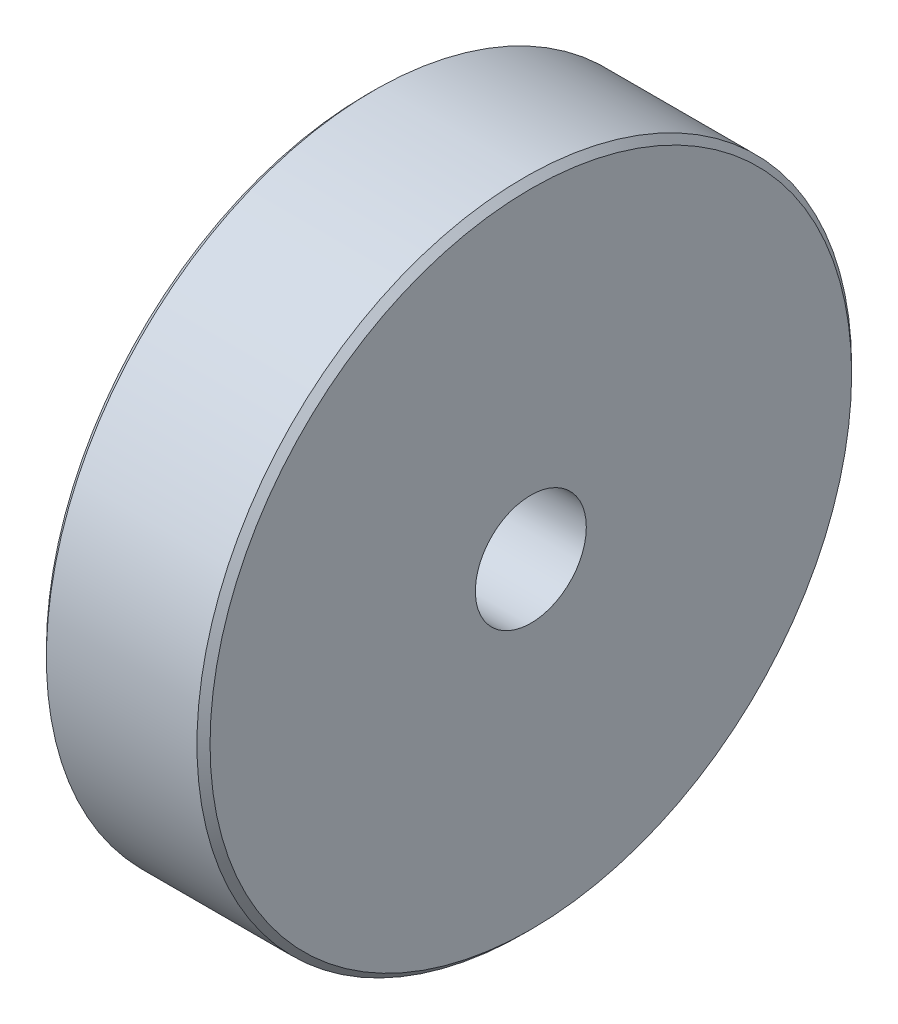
ISO-10303-21;
HEADER;
FILE_DESCRIPTION(('STEP AP214'),'2;1');
FILE_NAME('part.step','',(''),(''),'','','');
FILE_SCHEMA(('AUTOMOTIVE_DESIGN { 1 0 10303 214 1 1 1 1 }'));
ENDSEC;
DATA;
#1=APPLICATION_CONTEXT('core data for automotive mechanical design processes');
#2=APPLICATION_PROTOCOL_DEFINITION('international standard','automotive_design',2000,#1);
#3=PRODUCT_CONTEXT('',#1,'mechanical');
#4=PRODUCT('Part','Part','',(#3));
#5=PRODUCT_RELATED_PRODUCT_CATEGORY('part','',(#4));
#6=PRODUCT_DEFINITION_FORMATION('','',#4);
#7=PRODUCT_DEFINITION_CONTEXT('part definition',#1,'design');
#8=PRODUCT_DEFINITION('design','',#6,#7);
#9=PRODUCT_DEFINITION_SHAPE('','',#8);
#10=(LENGTH_UNIT() NAMED_UNIT(*) SI_UNIT(.MILLI.,.METRE.));
#11=(NAMED_UNIT(*) PLANE_ANGLE_UNIT() SI_UNIT($,.RADIAN.));
#12=(NAMED_UNIT(*) SI_UNIT($,.STERADIAN.) SOLID_ANGLE_UNIT());
#13=UNCERTAINTY_MEASURE_WITH_UNIT(LENGTH_MEASURE(1.E-05),#10,'distance_accuracy_value','');
#14=(GEOMETRIC_REPRESENTATION_CONTEXT(3) GLOBAL_UNCERTAINTY_ASSIGNED_CONTEXT((#13)) GLOBAL_UNIT_ASSIGNED_CONTEXT((#10,
#11,#12)) REPRESENTATION_CONTEXT('',''));
#15=CARTESIAN_POINT('',(0.,0.,0.));
#16=DIRECTION('',(0.,0.,1.));
#17=DIRECTION('',(1.,0.,0.));
#18=AXIS2_PLACEMENT_3D('',#15,#16,#17);
#19=CARTESIAN_POINT('',(6.35,0.,0.));
#20=DIRECTION('',(-1.,0.,0.));
#21=DIRECTION('',(0.,0.,1.));
#22=AXIS2_PLACEMENT_3D('',#19,#20,#21);
#23=CYLINDRICAL_SURFACE('',#22,12.7);
#24=CARTESIAN_POINT('',(6.096,0.,0.));
#25=DIRECTION('',(1.,0.,0.));
#26=DIRECTION('',(0.,0.,-1.));
#27=AXIS2_PLACEMENT_3D('',#24,#25,#26);
#28=CIRCLE('',#27,12.7);
#29=CARTESIAN_POINT('',(6.096,0.,-12.7));
#30=VERTEX_POINT('',#29);
#31=EDGE_CURVE('E40',#30,#30,#28,.F.);
#32=ORIENTED_EDGE('',*,*,#31,.T.);
#33=EDGE_LOOP('',(#32));
#34=FACE_BOUND('',#33,.T.);
#35=CARTESIAN_POINT('',(0.254000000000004,0.,0.));
#36=DIRECTION('',(1.,0.,0.));
#37=DIRECTION('',(0.,0.,-1.));
#38=AXIS2_PLACEMENT_3D('',#35,#36,#37);
#39=CIRCLE('',#38,12.7);
#40=CARTESIAN_POINT('',(0.254000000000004,0.,-12.7));
#41=VERTEX_POINT('',#40);
#42=EDGE_CURVE('E44',#41,#41,#39,.T.);
#43=ORIENTED_EDGE('',*,*,#42,.T.);
#44=EDGE_LOOP('',(#43));
#45=FACE_BOUND('',#44,.T.);
#46=ADVANCED_FACE('F33',(#34,#45),#23,.T.);
#47=CARTESIAN_POINT('',(6.35,0.,0.));
#48=DIRECTION('',(1.,0.,0.));
#49=DIRECTION('',(0.,0.,-1.));
#50=AXIS2_PLACEMENT_3D('',#47,#48,#49);
#51=PLANE('',#50);
#52=CARTESIAN_POINT('',(6.35,0.,0.));
#53=DIRECTION('',(1.,0.,0.));
#54=DIRECTION('',(0.,0.,-1.));
#55=AXIS2_PLACEMENT_3D('',#52,#53,#54);
#56=CIRCLE('',#55,12.446);
#57=CARTESIAN_POINT('',(6.35,0.,-12.446));
#58=VERTEX_POINT('',#57);
#59=EDGE_CURVE('E48',#58,#58,#56,.T.);
#60=ORIENTED_EDGE('',*,*,#59,.T.);
#61=EDGE_LOOP('',(#60));
#62=FACE_BOUND('',#61,.T.);
#63=CARTESIAN_POINT('',(6.35,0.,0.));
#64=DIRECTION('',(1.,0.,0.));
#65=DIRECTION('',(0.,0.,-1.));
#66=AXIS2_PLACEMENT_3D('',#63,#64,#65);
#67=CIRCLE('',#66,2.15265);
#68=CARTESIAN_POINT('',(6.35,0.,-2.15265));
#69=VERTEX_POINT('',#68);
#70=EDGE_CURVE('E56',#69,#69,#67,.T.);
#71=ORIENTED_EDGE('',*,*,#70,.F.);
#72=EDGE_LOOP('',(#71));
#73=FACE_BOUND('',#72,.T.);
#74=ADVANCED_FACE('F63',(#62,#73),#51,.T.);
#75=CARTESIAN_POINT('',(0.,0.,0.));
#76=DIRECTION('',(1.,0.,0.));
#77=DIRECTION('',(0.,0.,-1.));
#78=AXIS2_PLACEMENT_3D('',#75,#76,#77);
#79=PLANE('',#78);
#80=CARTESIAN_POINT('',(0.,0.,0.));
#81=DIRECTION('',(1.,0.,0.));
#82=DIRECTION('',(0.,0.,-1.));
#83=AXIS2_PLACEMENT_3D('',#80,#81,#82);
#84=CIRCLE('',#83,12.446);
#85=CARTESIAN_POINT('',(0.,0.,-12.446));
#86=VERTEX_POINT('',#85);
#87=EDGE_CURVE('E10',#86,#86,#84,.F.);
#88=ORIENTED_EDGE('',*,*,#87,.T.);
#89=EDGE_LOOP('',(#88));
#90=FACE_BOUND('',#89,.T.);
#91=CARTESIAN_POINT('',(0.,0.,0.));
#92=DIRECTION('',(1.,0.,0.));
#93=DIRECTION('',(0.,0.,-1.));
#94=AXIS2_PLACEMENT_3D('',#91,#92,#93);
#95=CIRCLE('',#94,2.15265);
#96=CARTESIAN_POINT('',(0.,0.,-2.15265));
#97=VERTEX_POINT('',#96);
#98=EDGE_CURVE('E53',#97,#97,#95,.T.);
#99=ORIENTED_EDGE('',*,*,#98,.T.);
#100=EDGE_LOOP('',(#99));
#101=FACE_BOUND('',#100,.T.);
#102=ADVANCED_FACE('F65',(#90,#101),#79,.F.);
#103=CARTESIAN_POINT('',(6.35,0.,0.));
#104=DIRECTION('',(1.,0.,0.));
#105=DIRECTION('',(0.,0.,-1.));
#106=AXIS2_PLACEMENT_3D('',#103,#104,#105);
#107=CYLINDRICAL_SURFACE('',#106,2.15265);
#108=ORIENTED_EDGE('',*,*,#70,.T.);
#109=EDGE_LOOP('',(#108));
#110=FACE_BOUND('',#109,.T.);
#111=ORIENTED_EDGE('',*,*,#98,.F.);
#112=EDGE_LOOP('',(#111));
#113=FACE_BOUND('',#112,.T.);
#114=ADVANCED_FACE('F60',(#110,#113),#107,.F.);
#115=CARTESIAN_POINT('',(6.35,0.,0.));
#116=DIRECTION('',(-1.,0.,0.));
#117=DIRECTION('',(0.,0.,1.));
#118=AXIS2_PLACEMENT_3D('',#115,#116,#117);
#119=CONICAL_SURFACE('',#118,12.446,0.785398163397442);
#120=ORIENTED_EDGE('',*,*,#31,.F.);
#121=EDGE_LOOP('',(#120));
#122=FACE_BOUND('',#121,.T.);
#123=ORIENTED_EDGE('',*,*,#59,.F.);
#124=EDGE_LOOP('',(#123));
#125=FACE_BOUND('',#124,.T.);
#126=ADVANCED_FACE('F75',(#122,#125),#119,.T.);
#127=CARTESIAN_POINT('',(0.254000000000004,0.,0.));
#128=DIRECTION('',(1.,0.,0.));
#129=DIRECTION('',(0.,0.,-1.));
#130=AXIS2_PLACEMENT_3D('',#127,#128,#129);
#131=CONICAL_SURFACE('',#130,12.7,0.785398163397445);
#132=ORIENTED_EDGE('',*,*,#87,.F.);
#133=EDGE_LOOP('',(#132));
#134=FACE_BOUND('',#133,.T.);
#135=ORIENTED_EDGE('',*,*,#42,.F.);
#136=EDGE_LOOP('',(#135));
#137=FACE_BOUND('',#136,.T.);
#138=ADVANCED_FACE('F35',(#134,#137),#131,.T.);
#139=CLOSED_SHELL('',(#46,#74,#102,#114,#126,#138));
#140=MANIFOLD_SOLID_BREP('B2',#139);
#141=ADVANCED_BREP_SHAPE_REPRESENTATION('',(#18,#140),#14);
#142=SHAPE_DEFINITION_REPRESENTATION(#9,#141);
ENDSEC;
END-ISO-10303-21;
